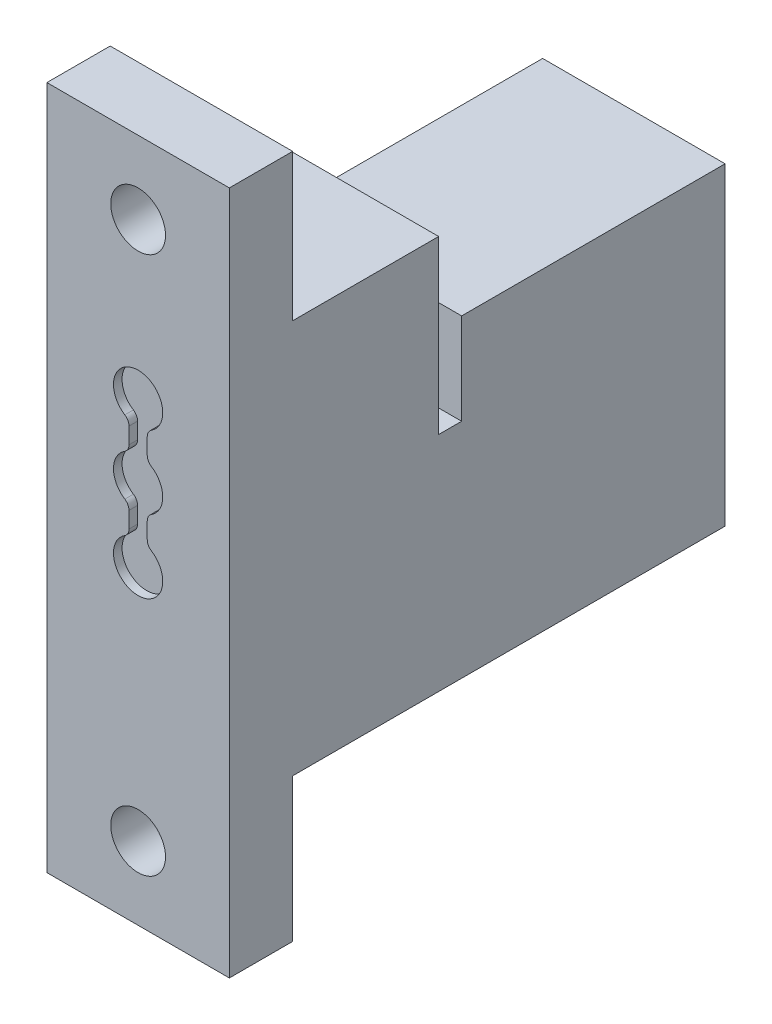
from build123d import *

# Parameters (mm, degrees)
SKETCH6_W          = 10
SKETCH6_H          = 37.5
EXTRUDE1_DEPTH     = 3.47
SKETCH9_R          = 1.5
CUT_EXTRUDE1_DEPTH = 3.47
SKETCH15_W         = 10
SKETCH15_H         = 21.6
EXTRUDE2_DEPTH     = 8
SKETCH16_W         = 10
SKETCH16_H         = 17.2
EXTRUDE3_DEPTH     = 15.7
SKETCH17_W         = 10
SKETCH17_H         = 1.26
CUT_EXTRUDE3_DEPTH = 5
CUT_EXTRUDE4_DEPTH = 0.47


with BuildPart() as part:
    # Sketch6 → Extrude1 (new body)
    with BuildSketch(Plane.XY):
        with Locations((0, 1.75)):
            Rectangle(SKETCH6_W, SKETCH6_H)
    extrude(amount=-EXTRUDE1_DEPTH)

    # Sketch9 → Cut-Extrude1 (cut)
    with BuildSketch(Plane.XY):
        with Locations((0, 16.5)):
            Circle(SKETCH9_R)
        with Locations((0, -13)):
            Circle(SKETCH9_R)
    extrude(amount=-CUT_EXTRUDE1_DEPTH, mode=Mode.SUBTRACT)

    # Sketch15 → Extrude2 (add)
    with BuildSketch(Plane(origin=(0, 0, -3.47), x_dir=(-1, 0, 0), z_dir=(0, 0, -1))):
        with Locations((0, 1.66)):
            Rectangle(SKETCH15_W, SKETCH15_H)
    extrude(amount=EXTRUDE2_DEPTH)

    # Sketch16 → Extrude3 (add)
    with BuildSketch(Plane(origin=(0, 0, -11.47), x_dir=(-1, 0, 0), z_dir=(0, 0, -1))):
        with Locations((0, -0.54)):
            Rectangle(SKETCH16_W, SKETCH16_H)
    extrude(amount=EXTRUDE3_DEPTH)

    # Sketch17 → Cut-Extrude3 (cut)
    with BuildSketch(Plane(origin=(0, 8.06, 0), x_dir=(-1, 0, 0), z_dir=(0, 1, 0))):
        with Locations((0, -12.1)):
            Rectangle(SKETCH17_W, SKETCH17_H)
    extrude(amount=-CUT_EXTRUDE3_DEPTH, mode=Mode.SUBTRACT)

    # Sketch19 → Cut-Extrude4 (cut)
    with BuildSketch(Plane.XY):
        with BuildLine():
            Line((-0.5, 6.443561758), (-0.5, 5.556438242))
            ThreePointArc((-0.5, 5.556438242), (-0.561174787, 5.316787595), (-0.72972973, 5.135779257))
            ThreePointArc((-0.72972973, 5.135779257), (-1.35, 4), (-0.72972973, 2.864220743))
            ThreePointArc((-0.72972973, 2.864220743), (-0.561174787, 2.683212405), (-0.5, 2.443561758))
            Line((-0.5, 2.443561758), (-0.5, 1.556438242))
            ThreePointArc((-0.5, 1.556438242), (-0.561174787, 1.316787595), (-0.72972973, 1.135779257))
            ThreePointArc((-0.72972973, 1.135779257), (0, -1.35), (0.72972973, 1.135779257))
            ThreePointArc((0.72972973, 1.135779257), (0.561174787, 1.316787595), (0.5, 1.556438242))
            Line((0.5, 1.556438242), (0.5, 2.443561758))
            ThreePointArc((0.5, 2.443561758), (0.561174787, 2.683212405), (0.72972973, 2.864220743))
            ThreePointArc((0.72972973, 2.864220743), (1.35, 4), (0.72972973, 5.135779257))
            ThreePointArc((0.72972973, 5.135779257), (0.561174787, 5.316787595), (0.5, 5.556438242))
            Line((0.5, 5.556438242), (0.5, 6.443561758))
            ThreePointArc((0.5, 6.443561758), (0.561174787, 6.683212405), (0.72972973, 6.864220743))
            ThreePointArc((0.72972973, 6.864220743), (0, 9.35), (-0.72972973, 6.864220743))
            ThreePointArc((-0.72972973, 6.864220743), (-0.561174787, 6.683212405), (-0.5, 6.443561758))
        make_face()
    extrude(amount=-CUT_EXTRUDE4_DEPTH, mode=Mode.SUBTRACT)


solid = part.part
